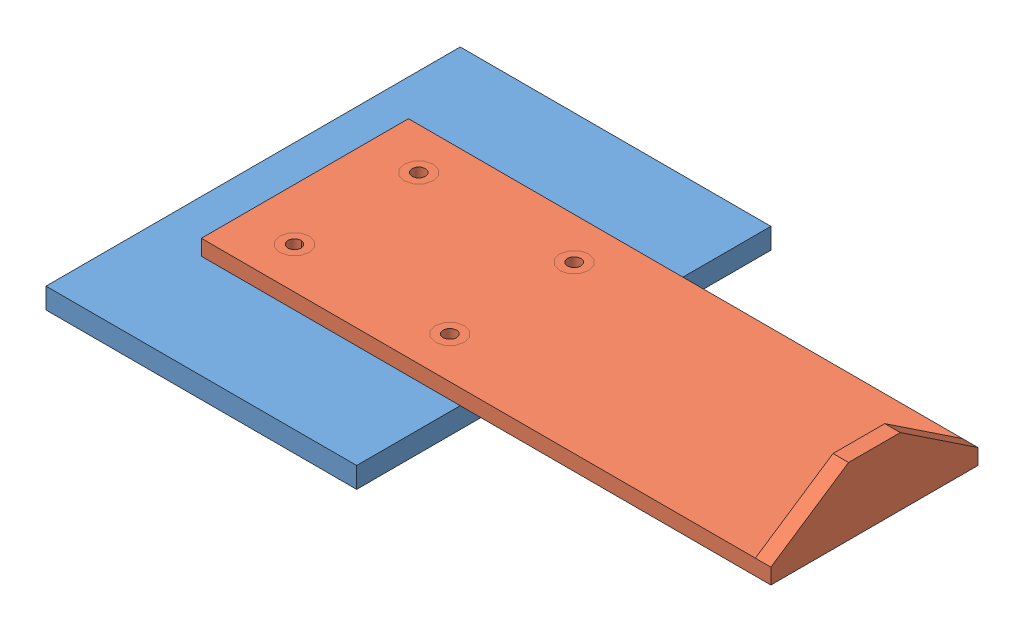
SolidWorks assembly Support Plate and Angle Bracket.SLDASM, configuration Default (file format 3100). Lengths in mm.
Overall size (600 85 400).
2 component instances, 2 part files, 2 mates.
Components (placement in the parent):
- Support Plate-1: Support Plate.SLDPRT [Default] at origin size (300 20 400)
- Angle Bracket-1: Angle Bracket.SLDPRT [Default] at (-100 15 0) size (550 65 200)
Mates (geometry in assembly coordinates):
- Coincident1: coincident anti-aligned: plane of Support Plate-1 through (-150 0 200) normal (0 1 0); plane of Angle Bracket-1 through (-100 0 -100) normal (0 -1 0)
- Concentric1: concentric aligned: cylinder of Support Plate-1; cylinder of Angle Bracket-1
